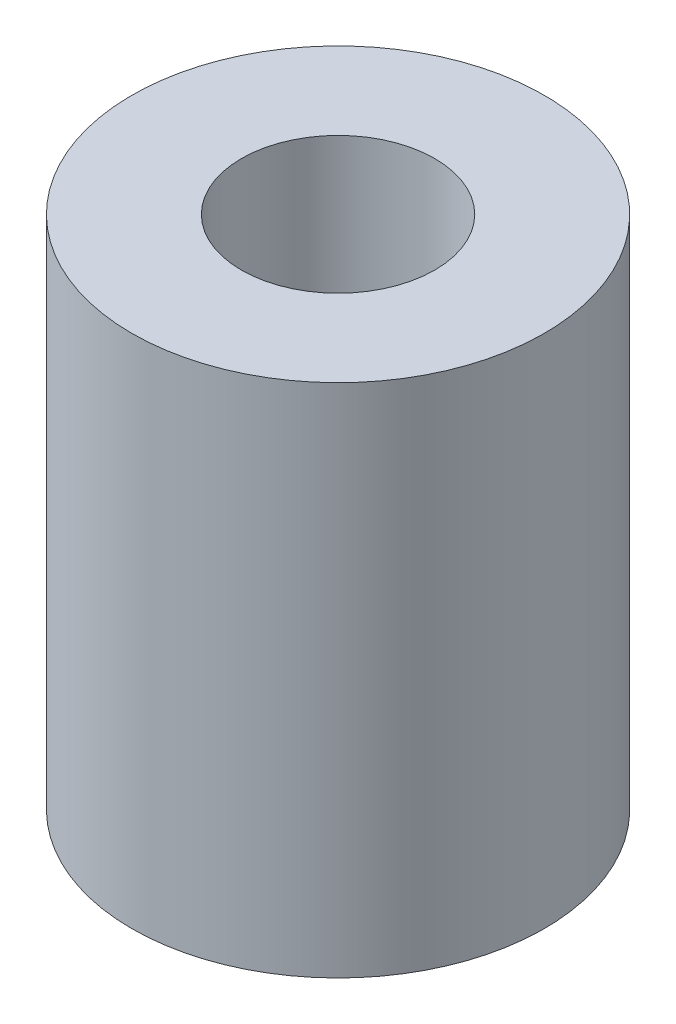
from build123d import *

# Parameters (mm, degrees)
SKETCH1_R           = 5.08
SKETCH1_R_2         = 2.38125
BOSS_EXTRUDE1_DEPTH = 12.7


with BuildPart() as part:
    # Sketch1 → Boss-Extrude1 (new body)
    with BuildSketch(Plane(origin=(0, 0, 0), x_dir=(1, 0, 0), z_dir=(0, 1, 0))):
        with Locations(Location((0, 0, 0), (0, 0, 270))):
            Circle(SKETCH1_R)
        with Locations(Location((0, 0, 0), (0, 0, 270))):
            Circle(SKETCH1_R_2, mode=Mode.SUBTRACT)
    extrude(amount=BOSS_EXTRUDE1_DEPTH)


solid = part.part
